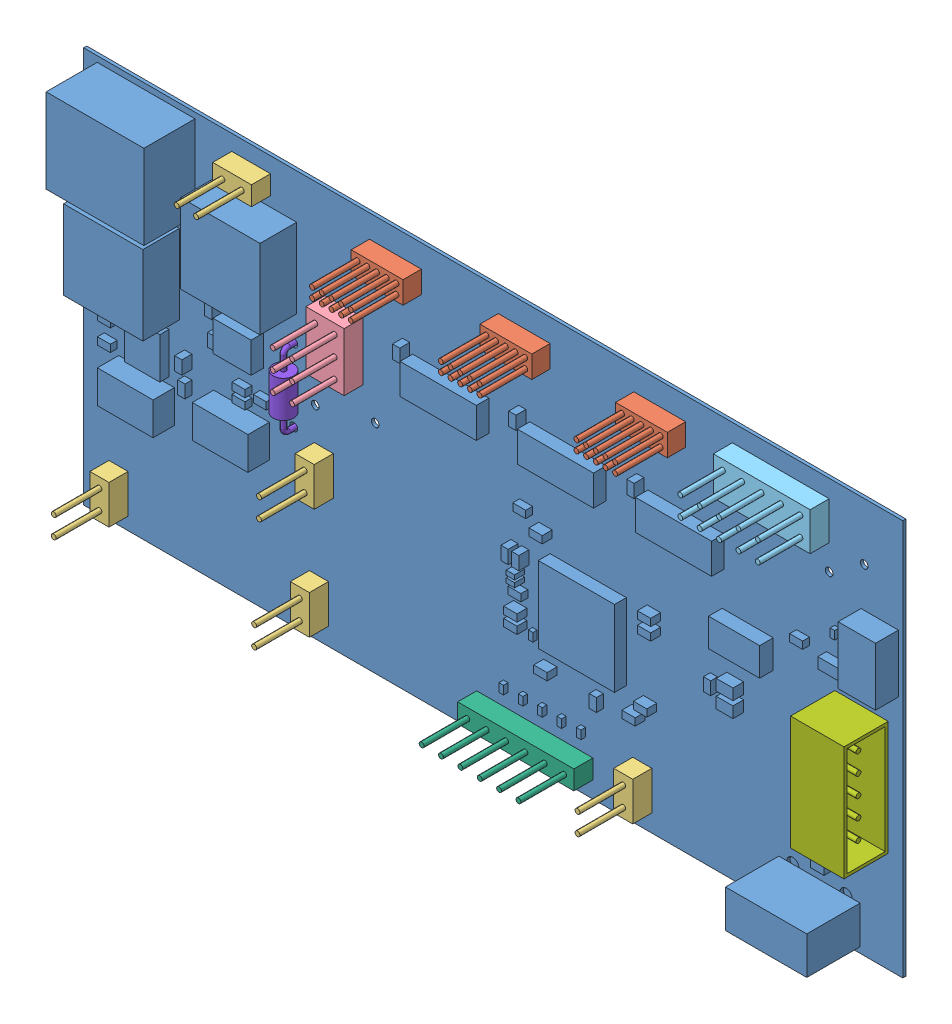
SolidWorks assembly Assem1.SLDASM, configuration 默认 (file format 9000). Lengths in mm.
Overall size (107.44 51.94 11.9).
14 component instances, 8 part files, 39 mates.
Components (placement in the parent):
- MG_V31-1: MG_V31.SLDPRT [默认] at (-88.6422 -84.8342 105.1677) size (107.44 51.94 9.45)
- HP2X5-1: HP2X5.SLDPRT [默认] at (-11.7092 21.9198 107.5677) x (-1 0 0) z (0 0 -1) size (6.8 2.9 11.4)
- HP2X5-2: HP2X5.SLDPRT [默认] at (5.1818 21.9198 107.5677) x (-1 0 0) z (0 0 -1) size (6.8 2.9 11.4)
- HP2X5-3: HP2X5.SLDPRT [默认] at (16.1618 24.8198 107.5677) x (1 0 0) z (0 0 -1) size (6.8 2.9 11.4)
- P1X2-1: P1X2.SLDPRT [默认] at (-36.5722 25.7628 107.6677) x (1 0 0) z (0 0 -1) size (5.08 2.5 11.5)
- P1X2-2: P1X2.SLDPRT [默认] at (18.5258 -16.7622 107.6677) x (0 -1 0) z (0 0 -1) size (5.08 2.5 11.5)
- P1X2-3: P1X2.SLDPRT [默认] at (-26.3922 -21.8422 107.6677) x (0 1 0) z (0 0 -1) size (5.08 2.5 11.5)
- P1X2-4: P1X2.SLDPRT [默认] at (-52.6812 -22.4772 107.6677) x (0 1 0) z (0 0 -1) size (5.08 2.5 11.5)
- P1X2-5: P1X2.SLDPRT [默认] at (-23.2572 -1.9032 107.6677) x (0 -1 0) z (0 0 -1) size (5.08 2.5 11.5)
- P2X3-1: P2X3.SLDPRT [默认] at (-24.3402 7.8758 107.6677) x (0 1 0) z (0 0 -1) size (7.62 5 11.4)
- P2X5-1: P2X5.SLDPRT [默认] at (41.7868 20.4888 107.6677) x (-1 0 0) z (0 0 -1) size (12.7 5 11.4)
- P1X6-1: P1X6.SLDPRT [默认] at (10.7988 -21.9492 107.6677) x (-1 0 0) z (0 0 -1) size (15.24 2.5 11.5)
- P5JACK-1: P5JACK.SLDPRT [默认] at (49.5298 4.0728 110.9677) x (0 -1 0) z (0 0 -1) size (15 7 9.2)
- Diode-1: Diode.SLDPRT [默认] at (-28.4442 0.8738 106.5177) x (0 0 -1) z (0 1 0) size (4.75 2.7 10.24)
Mates (geometry in assembly coordinates):
- Coincident1: coincident anti-aligned: plane of MG_V31-1 through (-56.0032 27.8148 105.1677) normal (0 0 1); plane of HP2X5-1 through (-11.7092 21.9198 105.1677) normal (0 0 -1)
- Concentric1: concentric anti-aligned: cylinder of MG_V31-1 through (-12.5692 22.7348 104.7562) axis (0 0 -1) radius 0.3; cylinder of HP2X5-1 through (-12.5692 22.7348 102.1677) axis (0 0 1) radius 0.32
- Concentric2: concentric anti-aligned: cylinder of MG_V31-1 through (-17.6492 22.7348 104.7562) axis (0 0 -1) radius 0.3; cylinder of HP2X5-1 through (-17.6492 22.7348 102.1677) axis (0 0 1) radius 0.32
- Coincident2: coincident anti-aligned: plane of MG_V31-1 through (-56.0032 27.8148 105.1677) normal (0 0 1); plane of HP2X5-2 through (5.1818 21.9198 105.1677) normal (0 0 -1)
- Concentric3: concentric anti-aligned: cylinder of MG_V31-1 through (-0.7582 22.7348 104.7562) axis (0 0 -1) radius 0.3; cylinder of HP2X5-2 through (-0.7582 22.7348 102.1677) axis (0 0 1) radius 0.32
- Concentric4: concentric anti-aligned: cylinder of MG_V31-1 through (4.3218 24.0048 104.7562) axis (0 0 -1) radius 0.3; cylinder of HP2X5-2 through (4.3218 24.0048 102.1677) axis (0 0 1) radius 0.32
- Coincident3: coincident anti-aligned: plane of MG_V31-1 through (-56.0032 27.8148 105.1677) normal (0 0 1); plane of HP2X5-3 through (16.1618 24.8198 105.1677) normal (0 0 -1)
- Concentric5: concentric anti-aligned: circle of MG_V31-1; cylinder of HP2X5-3 through (17.0218 22.7348 102.1677) axis (0 0 1) radius 0.32
- Concentric6: concentric anti-aligned: cylinder of MG_V31-1 through (22.1018 22.7348 104.7562) axis (0 0 -1) radius 0.3; cylinder of HP2X5-3 through (22.1018 22.7348 102.1677) axis (0 0 1) radius 0.32
- Coincident4: coincident anti-aligned: plane of MG_V31-1 through (-56.0032 27.8148 105.1677) normal (0 0 1); plane of P1X2-1 through (-36.5722 25.7628 105.1677) normal (0 0 -1)
- Concentric7: concentric anti-aligned: cylinder of MG_V31-1 through (-35.3022 24.5128 104.7562) axis (0 0 -1) radius 0.45; cylinder of P1X2-1 through (-35.3022 24.5128 102.1677) axis (0 0 1) radius 0.32
- Concentric8: concentric anti-aligned: cylinder of MG_V31-1 through (-32.7622 24.5128 104.7562) axis (0 0 -1) radius 0.45; cylinder of P1X2-1 through (-32.7622 24.5128 102.1677) axis (0 0 1) radius 0.32
- Coincident5: coincident anti-aligned: plane of MG_V31-1 through (-56.0032 27.8148 105.1677) normal (0 0 1); plane of P1X2-2 through (18.5258 -16.7622 105.1677) normal (0 0 -1)
- Concentric9: concentric anti-aligned: cylinder of MG_V31-1 through (17.2758 -20.5722 104.7562) axis (0 0 -1) radius 0.45; cylinder of P1X2-2 through (17.2758 -20.5722 102.1677) axis (0 0 1) radius 0.32
- Concentric10: concentric anti-aligned: cylinder of MG_V31-1 through (17.2758 -18.0322 104.7562) axis (0 0 -1) radius 0.45; cylinder of P1X2-2 through (17.2758 -18.0322 102.1677) axis (0 0 1) radius 0.32
- Coincident6: coincident anti-aligned: plane of MG_V31-1 through (-56.0032 27.8148 105.1677) normal (0 0 1); plane of P1X2-3 through (-26.3922 -21.8422 105.1677) normal (0 0 -1)
- Concentric11: concentric anti-aligned: cylinder of MG_V31-1 through (-25.1422 -20.5722 104.7562) axis (0 0 -1) radius 0.45; cylinder of P1X2-3 through (-25.1422 -20.5722 102.1677) axis (0 0 1) radius 0.32
- Concentric12: concentric anti-aligned: cylinder of MG_V31-1 through (-25.1422 -18.0322 104.7562) axis (0 0 -1) radius 0.45; cylinder of P1X2-3 through (-25.1422 -18.0322 102.1677) axis (0 0 1) radius 0.32
- Coincident7: coincident anti-aligned: plane of MG_V31-1 through (-56.0032 27.8148 105.1677) normal (0 0 1); plane of P1X2-4 through (-52.6812 -22.4772 105.1677) normal (0 0 -1)
- Concentric13: concentric anti-aligned: cylinder of MG_V31-1 through (-51.4312 -21.2072 104.7562) axis (0 0 -1) radius 0.45; cylinder of P1X2-4 through (-51.4312 -21.2072 102.1677) axis (0 0 1) radius 0.32
- Concentric14: concentric anti-aligned: cylinder of MG_V31-1 through (-51.4312 -18.6672 104.7562) axis (0 0 -1) radius 0.45; cylinder of P1X2-4 through (-51.4312 -18.6672 102.1677) axis (0 0 1) radius 0.32
- Coincident8: coincident anti-aligned: plane of MG_V31-1 through (-56.0032 27.8148 105.1677) normal (0 0 1); plane of P1X2-5 through (-23.2572 -1.9032 105.1677) normal (0 0 -1)
- Concentric15: concentric anti-aligned: cylinder of MG_V31-1 through (-24.5072 -5.7132 104.7562) axis (0 0 -1) radius 0.45; cylinder of P1X2-5 through (-24.5072 -5.7132 102.1677) axis (0 0 1) radius 0.32
- Concentric16: concentric anti-aligned: cylinder of MG_V31-1 through (-24.5072 -3.1732 104.7562) axis (0 0 -1) radius 0.45; cylinder of P1X2-5 through (-24.5072 -3.1732 102.1677) axis (0 0 1) radius 0.32
- Coincident9: coincident anti-aligned: plane of MG_V31-1 through (-56.0032 27.8148 105.1677) normal (0 0 1); plane of P2X3-1 through (-24.3402 7.8758 105.1677) normal (0 0 -1)
- Concentric19: concentric anti-aligned: cylinder of MG_V31-1 through (-20.5702 14.2258 104.7562) axis (0 0 -1) radius 0.45; cylinder of P2X3-1 through (-20.5702 14.2258 101.8677) axis (0 0 1) radius 0.32
- Concentric20: concentric anti-aligned: cylinder of MG_V31-1 through (-23.1102 14.2258 104.7562) axis (0 0 -1) radius 0.45; cylinder of P2X3-1 through (-23.1102 14.2258 101.8677) axis (0 0 1) radius 0.32
- Coincident10: coincident anti-aligned: plane of MG_V31-1 through (-56.0032 27.8148 105.1677) normal (0 0 1); plane of P2X5-1 through (41.7868 20.4888 105.1677) normal (0 0 -1)
- Concentric21: concentric anti-aligned: cylinder of MG_V31-1 through (30.3568 21.7188 104.7562) axis (0 0 -1) radius 0.45; cylinder of P2X5-1 through (30.3568 21.7188 101.8677) axis (0 0 1) radius 0.32
- Concentric22: concentric anti-aligned: cylinder of MG_V31-1 through (40.5168 24.2588 104.7562) axis (0 0 -1) radius 0.45; cylinder of P2X5-1 through (40.5168 24.2588 101.8677) axis (0 0 1) radius 0.32
- Coincident11: coincident anti-aligned: plane of MG_V31-1 through (-56.0032 27.8148 105.1677) normal (0 0 1); plane of P1X6-1 through (10.7988 -21.9492 105.1677) normal (0 0 -1)
- Concentric23: concentric anti-aligned: cylinder of MG_V31-1 through (-3.1712 -20.6992 104.7562) axis (0 0 -1) radius 0.45; cylinder of P1X6-1 through (-3.1712 -20.6992 102.1677) axis (0 0 1) radius 0.32
- Concentric24: concentric anti-aligned: cylinder of MG_V31-1 through (9.5288 -20.6992 104.7562) axis (0 0 -1) radius 0.45; cylinder of P1X6-1 through (9.5288 -20.6992 102.1677) axis (0 0 1) radius 0.32
- Coincident12: coincident anti-aligned: plane of MG_V31-1 through (-56.0032 27.8148 105.1677) normal (0 0 1); plane of P5JACK-1 through (49.5298 4.0728 105.1677) normal (0 0 -1)
- Concentric25: concentric anti-aligned: cylinder of MG_V31-1 through (42.9298 1.6528 104.7562) axis (0 0 -1) radius 0.45; cylinder of P5JACK-1 through (42.9298 1.6528 101.7677) axis (0 0 1) radius 0.32
- Concentric26: concentric anti-aligned: cylinder of MG_V31-1 through (42.9298 -8.5072 104.7562) axis (0 0 -1) radius 0.45; cylinder of P5JACK-1 through (42.9298 -8.5072 101.7677) axis (0 0 1) radius 0.32
- Concentric27: concentric: cylinder of MG_V31-1 through (-28.4442 8.0738 104.7562) axis (0 0 -1) radius 0.525; cylinder of Diode-1 through (-28.4442 8.0738 105.9177) axis (0 0 -1) radius 0.32
- Tangent1: tangent: plane of MG_V31-1 through (-56.0032 27.8148 105.1677) normal (0 0 1); cylinder of Diode-1 through (-27.6612 5.8051 106.5177) axis (0.326242 -0.945286 0) radius 1.35
- Parallel3: parallel aligned: line of MG_V31-1 through (-32.2942 7.3358 105.2677) axis (0 -1 0); cylinder of Diode-1 through (-28.4442 5.6738 106.5177) axis (0 -1 0) radius 1.35
